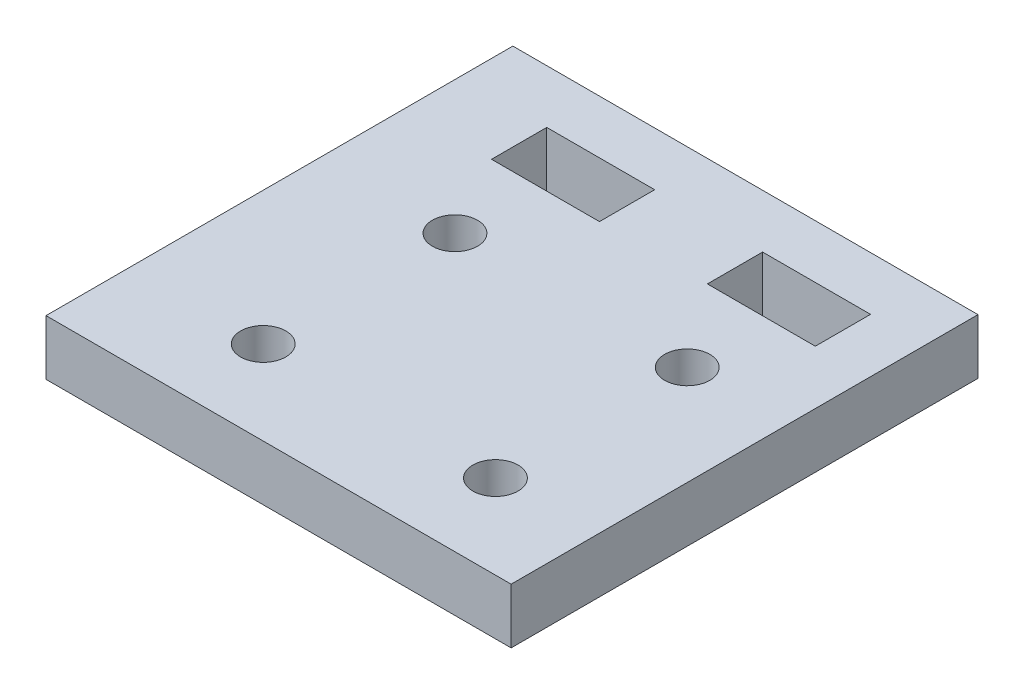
ISO-10303-21;
HEADER;
FILE_DESCRIPTION(('STEP AP214'),'2;1');
FILE_NAME('part.step','',(''),(''),'','','');
FILE_SCHEMA(('AUTOMOTIVE_DESIGN { 1 0 10303 214 1 1 1 1 }'));
ENDSEC;
DATA;
#1=APPLICATION_CONTEXT('core data for automotive mechanical design processes');
#2=APPLICATION_PROTOCOL_DEFINITION('international standard','automotive_design',2000,#1);
#3=PRODUCT_CONTEXT('',#1,'mechanical');
#4=PRODUCT('Part','Part','',(#3));
#5=PRODUCT_RELATED_PRODUCT_CATEGORY('part','',(#4));
#6=PRODUCT_DEFINITION_FORMATION('','',#4);
#7=PRODUCT_DEFINITION_CONTEXT('part definition',#1,'design');
#8=PRODUCT_DEFINITION('design','',#6,#7);
#9=PRODUCT_DEFINITION_SHAPE('','',#8);
#10=(LENGTH_UNIT() NAMED_UNIT(*) SI_UNIT(.MILLI.,.METRE.));
#11=(NAMED_UNIT(*) PLANE_ANGLE_UNIT() SI_UNIT($,.RADIAN.));
#12=(NAMED_UNIT(*) SI_UNIT($,.STERADIAN.) SOLID_ANGLE_UNIT());
#13=UNCERTAINTY_MEASURE_WITH_UNIT(LENGTH_MEASURE(1.E-05),#10,'distance_accuracy_value','');
#14=(GEOMETRIC_REPRESENTATION_CONTEXT(3) GLOBAL_UNCERTAINTY_ASSIGNED_CONTEXT((#13)) GLOBAL_UNIT_ASSIGNED_CONTEXT((#10,
#11,#12)) REPRESENTATION_CONTEXT('',''));
#15=CARTESIAN_POINT('',(0.,0.,0.));
#16=DIRECTION('',(0.,0.,1.));
#17=DIRECTION('',(1.,0.,0.));
#18=AXIS2_PLACEMENT_3D('',#15,#16,#17);
#19=CARTESIAN_POINT('',(0.,5.5,0.));
#20=DIRECTION('',(0.,-1.,0.));
#21=DIRECTION('',(0.,0.,-1.));
#22=AXIS2_PLACEMENT_3D('',#19,#20,#21);
#23=PLANE('',#22);
#24=DIRECTION('',(0.,0.,-1.));
#25=VECTOR('',#24,1.);
#26=CARTESIAN_POINT('',(-26.875,5.5,-48.5));
#27=LINE('',#26,#25);
#28=CARTESIAN_POINT('',(-26.875,5.5,-43.));
#29=VERTEX_POINT('',#28);
#30=CARTESIAN_POINT('',(-26.875,5.5,-48.5));
#31=VERTEX_POINT('',#30);
#32=EDGE_CURVE('E165',#29,#31,#27,.T.);
#33=ORIENTED_EDGE('',*,*,#32,.F.);
#34=DIRECTION('',(1.,0.,0.));
#35=VECTOR('',#34,1.);
#36=CARTESIAN_POINT('',(-26.875,5.5,-43.));
#37=LINE('',#36,#35);
#38=CARTESIAN_POINT('',(-37.625,5.5,-43.));
#39=VERTEX_POINT('',#38);
#40=EDGE_CURVE('E173',#39,#29,#37,.T.);
#41=ORIENTED_EDGE('',*,*,#40,.F.);
#42=DIRECTION('',(0.,0.,1.));
#43=VECTOR('',#42,1.);
#44=CARTESIAN_POINT('',(-37.625,5.5,-43.));
#45=LINE('',#44,#43);
#46=CARTESIAN_POINT('',(-37.625,5.5,-48.5));
#47=VERTEX_POINT('',#46);
#48=EDGE_CURVE('E170',#47,#39,#45,.T.);
#49=ORIENTED_EDGE('',*,*,#48,.F.);
#50=DIRECTION('',(-1.,0.,0.));
#51=VECTOR('',#50,1.);
#52=CARTESIAN_POINT('',(-37.625,5.5,-48.5));
#53=LINE('',#52,#51);
#54=EDGE_CURVE('E167',#31,#47,#53,.T.);
#55=ORIENTED_EDGE('',*,*,#54,.F.);
#56=EDGE_LOOP('',(#33,#41,#49,#55));
#57=FACE_BOUND('',#56,.T.);
#58=DIRECTION('',(0.,0.,-1.));
#59=VECTOR('',#58,1.);
#60=CARTESIAN_POINT('',(0.,5.5,-53.8278175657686));
#61=LINE('',#60,#59);
#62=CARTESIAN_POINT('',(0.,5.5,-7.32781756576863));
#63=VERTEX_POINT('',#62);
#64=CARTESIAN_POINT('',(0.,5.5,-53.8278175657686));
#65=VERTEX_POINT('',#64);
#66=EDGE_CURVE('E196',#63,#65,#61,.T.);
#67=ORIENTED_EDGE('',*,*,#66,.T.);
#68=DIRECTION('',(-1.,0.,0.));
#69=VECTOR('',#68,1.);
#70=CARTESIAN_POINT('',(-46.3278175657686,5.5,-53.8278175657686));
#71=LINE('',#70,#69);
#72=CARTESIAN_POINT('',(-46.3278175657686,5.5,-53.8278175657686));
#73=VERTEX_POINT('',#72);
#74=EDGE_CURVE('E199',#65,#73,#71,.T.);
#75=ORIENTED_EDGE('',*,*,#74,.T.);
#76=DIRECTION('',(0.,0.,1.));
#77=VECTOR('',#76,1.);
#78=CARTESIAN_POINT('',(-46.3278175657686,5.5,-7.32781756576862));
#79=LINE('',#78,#77);
#80=CARTESIAN_POINT('',(-46.3278175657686,5.5,-7.32781756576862));
#81=VERTEX_POINT('',#80);
#82=EDGE_CURVE('E202',#73,#81,#79,.T.);
#83=ORIENTED_EDGE('',*,*,#82,.T.);
#84=DIRECTION('',(1.,0.,0.));
#85=VECTOR('',#84,1.);
#86=CARTESIAN_POINT('',(0.,5.5,-7.32781756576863));
#87=LINE('',#86,#85);
#88=EDGE_CURVE('E204',#81,#63,#87,.T.);
#89=ORIENTED_EDGE('',*,*,#88,.T.);
#90=EDGE_LOOP('',(#67,#75,#83,#89));
#91=FACE_BOUND('',#90,.T.);
#92=DIRECTION('',(1.,0.,0.));
#93=VECTOR('',#92,1.);
#94=CARTESIAN_POINT('',(-5.375,5.5,-43.));
#95=LINE('',#94,#93);
#96=CARTESIAN_POINT('',(-16.125,5.5,-43.));
#97=VERTEX_POINT('',#96);
#98=CARTESIAN_POINT('',(-5.375,5.5,-43.));
#99=VERTEX_POINT('',#98);
#100=EDGE_CURVE('E126',#97,#99,#95,.T.);
#101=ORIENTED_EDGE('',*,*,#100,.F.);
#102=DIRECTION('',(0.,0.,1.));
#103=VECTOR('',#102,1.);
#104=CARTESIAN_POINT('',(-16.125,5.5,-43.));
#105=LINE('',#104,#103);
#106=CARTESIAN_POINT('',(-16.125,5.5,-48.5));
#107=VERTEX_POINT('',#106);
#108=EDGE_CURVE('E149',#107,#97,#105,.T.);
#109=ORIENTED_EDGE('',*,*,#108,.F.);
#110=DIRECTION('',(-1.,0.,0.));
#111=VECTOR('',#110,1.);
#112=CARTESIAN_POINT('',(-16.125,5.5,-48.5));
#113=LINE('',#112,#111);
#114=CARTESIAN_POINT('',(-5.375,5.5,-48.5));
#115=VERTEX_POINT('',#114);
#116=EDGE_CURVE('E147',#115,#107,#113,.T.);
#117=ORIENTED_EDGE('',*,*,#116,.F.);
#118=DIRECTION('',(0.,0.,-1.));
#119=VECTOR('',#118,1.);
#120=CARTESIAN_POINT('',(-5.375,5.5,-48.5));
#121=LINE('',#120,#119);
#122=EDGE_CURVE('E134',#99,#115,#121,.T.);
#123=ORIENTED_EDGE('',*,*,#122,.F.);
#124=EDGE_LOOP('',(#101,#109,#117,#123));
#125=FACE_BOUND('',#124,.T.);
#126=CARTESIAN_POINT('',(-33.067297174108,5.5,-34.7997453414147));
#127=DIRECTION('',(0.,1.,0.));
#128=DIRECTION('',(0.,0.,1.));
#129=AXIS2_PLACEMENT_3D('',#126,#127,#128);
#130=CIRCLE('',#129,2.25);
#131=CARTESIAN_POINT('',(-33.067297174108,5.5,-32.5497453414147));
#132=VERTEX_POINT('',#131);
#133=EDGE_CURVE('E155',#132,#132,#130,.T.);
#134=ORIENTED_EDGE('',*,*,#133,.F.);
#135=EDGE_LOOP('',(#134));
#136=FACE_BOUND('',#135,.T.);
#137=CARTESIAN_POINT('',(-9.93270282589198,5.5,-34.7997453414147));
#138=DIRECTION('',(0.,1.,0.));
#139=DIRECTION('',(0.,0.,1.));
#140=AXIS2_PLACEMENT_3D('',#137,#138,#139);
#141=CIRCLE('',#140,2.25);
#142=CARTESIAN_POINT('',(-9.93270282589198,5.5,-32.5497453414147));
#143=VERTEX_POINT('',#142);
#144=EDGE_CURVE('E335',#143,#143,#141,.T.);
#145=ORIENTED_EDGE('',*,*,#144,.F.);
#146=EDGE_LOOP('',(#145));
#147=FACE_BOUND('',#146,.T.);
#148=CARTESIAN_POINT('',(-9.93270282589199,5.5,-15.7002546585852));
#149=DIRECTION('',(0.,1.,0.));
#150=DIRECTION('',(0.,0.,1.));
#151=AXIS2_PLACEMENT_3D('',#148,#149,#150);
#152=CIRCLE('',#151,2.25);
#153=CARTESIAN_POINT('',(-9.93270282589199,5.5,-13.4502546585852));
#154=VERTEX_POINT('',#153);
#155=EDGE_CURVE('E329',#154,#154,#152,.T.);
#156=ORIENTED_EDGE('',*,*,#155,.F.);
#157=EDGE_LOOP('',(#156));
#158=FACE_BOUND('',#157,.T.);
#159=CARTESIAN_POINT('',(-33.067297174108,5.5,-15.7002546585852));
#160=DIRECTION('',(0.,1.,0.));
#161=DIRECTION('',(0.,0.,1.));
#162=AXIS2_PLACEMENT_3D('',#159,#160,#161);
#163=CIRCLE('',#162,2.25);
#164=CARTESIAN_POINT('',(-33.067297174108,5.5,-13.4502546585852));
#165=VERTEX_POINT('',#164);
#166=EDGE_CURVE('E320',#165,#165,#163,.T.);
#167=ORIENTED_EDGE('',*,*,#166,.F.);
#168=EDGE_LOOP('',(#167));
#169=FACE_BOUND('',#168,.T.);
#170=ADVANCED_FACE('F37',(#57,#91,#125,#136,#147,#158,#169),#23,.F.);
#171=CARTESIAN_POINT('',(0.,0.,0.));
#172=DIRECTION('',(0.,-1.,0.));
#173=DIRECTION('',(0.,0.,-1.));
#174=AXIS2_PLACEMENT_3D('',#171,#172,#173);
#175=PLANE('',#174);
#176=CARTESIAN_POINT('',(-9.93270282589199,0.,-15.7002546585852));
#177=DIRECTION('',(0.,1.,0.));
#178=DIRECTION('',(0.,0.,1.));
#179=AXIS2_PLACEMENT_3D('',#176,#177,#178);
#180=CIRCLE('',#179,2.25);
#181=CARTESIAN_POINT('',(-9.93270282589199,0.,-13.4502546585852));
#182=VERTEX_POINT('',#181);
#183=EDGE_CURVE('E326',#182,#182,#180,.T.);
#184=ORIENTED_EDGE('',*,*,#183,.T.);
#185=EDGE_LOOP('',(#184));
#186=FACE_BOUND('',#185,.T.);
#187=CARTESIAN_POINT('',(-33.067297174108,0.,-34.7997453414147));
#188=DIRECTION('',(0.,1.,0.));
#189=DIRECTION('',(0.,0.,1.));
#190=AXIS2_PLACEMENT_3D('',#187,#188,#189);
#191=CIRCLE('',#190,2.25);
#192=CARTESIAN_POINT('',(-33.067297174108,0.,-32.5497453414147));
#193=VERTEX_POINT('',#192);
#194=EDGE_CURVE('E338',#193,#193,#191,.T.);
#195=ORIENTED_EDGE('',*,*,#194,.T.);
#196=EDGE_LOOP('',(#195));
#197=FACE_BOUND('',#196,.T.);
#198=DIRECTION('',(0.,0.,-1.));
#199=VECTOR('',#198,1.);
#200=CARTESIAN_POINT('',(0.,0.,-53.8278175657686));
#201=LINE('',#200,#199);
#202=CARTESIAN_POINT('',(0.,0.,-7.32781756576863));
#203=VERTEX_POINT('',#202);
#204=CARTESIAN_POINT('',(0.,0.,-53.8278175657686));
#205=VERTEX_POINT('',#204);
#206=EDGE_CURVE('E195',#203,#205,#201,.T.);
#207=ORIENTED_EDGE('',*,*,#206,.F.);
#208=DIRECTION('',(1.,0.,0.));
#209=VECTOR('',#208,1.);
#210=CARTESIAN_POINT('',(0.,0.,-7.32781756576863));
#211=LINE('',#210,#209);
#212=CARTESIAN_POINT('',(-46.3278175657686,0.,-7.32781756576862));
#213=VERTEX_POINT('',#212);
#214=EDGE_CURVE('E200',#213,#203,#211,.T.);
#215=ORIENTED_EDGE('',*,*,#214,.F.);
#216=DIRECTION('',(0.,0.,1.));
#217=VECTOR('',#216,1.);
#218=CARTESIAN_POINT('',(-46.3278175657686,0.,-7.32781756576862));
#219=LINE('',#218,#217);
#220=CARTESIAN_POINT('',(-46.3278175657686,0.,-53.8278175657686));
#221=VERTEX_POINT('',#220);
#222=EDGE_CURVE('E211',#221,#213,#219,.T.);
#223=ORIENTED_EDGE('',*,*,#222,.F.);
#224=DIRECTION('',(-1.,0.,0.));
#225=VECTOR('',#224,1.);
#226=CARTESIAN_POINT('',(-46.3278175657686,0.,-53.8278175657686));
#227=LINE('',#226,#225);
#228=EDGE_CURVE('E209',#205,#221,#227,.T.);
#229=ORIENTED_EDGE('',*,*,#228,.F.);
#230=EDGE_LOOP('',(#207,#215,#223,#229));
#231=FACE_BOUND('',#230,.T.);
#232=DIRECTION('',(1.,0.,0.));
#233=VECTOR('',#232,1.);
#234=CARTESIAN_POINT('',(-26.875,0.,-43.));
#235=LINE('',#234,#233);
#236=CARTESIAN_POINT('',(-37.625,0.,-43.));
#237=VERTEX_POINT('',#236);
#238=CARTESIAN_POINT('',(-26.875,0.,-43.));
#239=VERTEX_POINT('',#238);
#240=EDGE_CURVE('E168',#237,#239,#235,.T.);
#241=ORIENTED_EDGE('',*,*,#240,.T.);
#242=DIRECTION('',(0.,0.,-1.));
#243=VECTOR('',#242,1.);
#244=CARTESIAN_POINT('',(-26.875,0.,-48.5));
#245=LINE('',#244,#243);
#246=CARTESIAN_POINT('',(-26.875,0.,-48.5));
#247=VERTEX_POINT('',#246);
#248=EDGE_CURVE('E142',#239,#247,#245,.T.);
#249=ORIENTED_EDGE('',*,*,#248,.T.);
#250=DIRECTION('',(-1.,0.,0.));
#251=VECTOR('',#250,1.);
#252=CARTESIAN_POINT('',(-37.625,0.,-48.5));
#253=LINE('',#252,#251);
#254=CARTESIAN_POINT('',(-37.625,0.,-48.5));
#255=VERTEX_POINT('',#254);
#256=EDGE_CURVE('E178',#247,#255,#253,.T.);
#257=ORIENTED_EDGE('',*,*,#256,.T.);
#258=DIRECTION('',(0.,0.,1.));
#259=VECTOR('',#258,1.);
#260=CARTESIAN_POINT('',(-37.625,0.,-43.));
#261=LINE('',#260,#259);
#262=EDGE_CURVE('E181',#255,#237,#261,.T.);
#263=ORIENTED_EDGE('',*,*,#262,.T.);
#264=EDGE_LOOP('',(#241,#249,#257,#263));
#265=FACE_BOUND('',#264,.T.);
#266=DIRECTION('',(0.,0.,1.));
#267=VECTOR('',#266,1.);
#268=CARTESIAN_POINT('',(-16.125,0.,-43.));
#269=LINE('',#268,#267);
#270=CARTESIAN_POINT('',(-16.125,0.,-48.5));
#271=VERTEX_POINT('',#270);
#272=CARTESIAN_POINT('',(-16.125,0.,-43.));
#273=VERTEX_POINT('',#272);
#274=EDGE_CURVE('E135',#271,#273,#269,.T.);
#275=ORIENTED_EDGE('',*,*,#274,.T.);
#276=DIRECTION('',(1.,0.,0.));
#277=VECTOR('',#276,1.);
#278=CARTESIAN_POINT('',(-5.375,0.,-43.));
#279=LINE('',#278,#277);
#280=CARTESIAN_POINT('',(-5.375,0.,-43.));
#281=VERTEX_POINT('',#280);
#282=EDGE_CURVE('E60',#273,#281,#279,.T.);
#283=ORIENTED_EDGE('',*,*,#282,.T.);
#284=DIRECTION('',(0.,0.,-1.));
#285=VECTOR('',#284,1.);
#286=CARTESIAN_POINT('',(-5.375,0.,-48.5));
#287=LINE('',#286,#285);
#288=CARTESIAN_POINT('',(-5.375,0.,-48.5));
#289=VERTEX_POINT('',#288);
#290=EDGE_CURVE('E141',#281,#289,#287,.T.);
#291=ORIENTED_EDGE('',*,*,#290,.T.);
#292=DIRECTION('',(-1.,0.,0.));
#293=VECTOR('',#292,1.);
#294=CARTESIAN_POINT('',(-16.125,0.,-48.5));
#295=LINE('',#294,#293);
#296=EDGE_CURVE('E157',#289,#271,#295,.T.);
#297=ORIENTED_EDGE('',*,*,#296,.T.);
#298=EDGE_LOOP('',(#275,#283,#291,#297));
#299=FACE_BOUND('',#298,.T.);
#300=CARTESIAN_POINT('',(-9.93270282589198,0.,-34.7997453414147));
#301=DIRECTION('',(0.,1.,0.));
#302=DIRECTION('',(0.,0.,1.));
#303=AXIS2_PLACEMENT_3D('',#300,#301,#302);
#304=CIRCLE('',#303,2.25);
#305=CARTESIAN_POINT('',(-9.93270282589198,0.,-32.5497453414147));
#306=VERTEX_POINT('',#305);
#307=EDGE_CURVE('E332',#306,#306,#304,.T.);
#308=ORIENTED_EDGE('',*,*,#307,.T.);
#309=EDGE_LOOP('',(#308));
#310=FACE_BOUND('',#309,.T.);
#311=CARTESIAN_POINT('',(-33.067297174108,0.,-15.7002546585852));
#312=DIRECTION('',(0.,1.,0.));
#313=DIRECTION('',(0.,0.,1.));
#314=AXIS2_PLACEMENT_3D('',#311,#312,#313);
#315=CIRCLE('',#314,2.25);
#316=CARTESIAN_POINT('',(-33.067297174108,0.,-13.4502546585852));
#317=VERTEX_POINT('',#316);
#318=EDGE_CURVE('E323',#317,#317,#315,.T.);
#319=ORIENTED_EDGE('',*,*,#318,.T.);
#320=EDGE_LOOP('',(#319));
#321=FACE_BOUND('',#320,.T.);
#322=ADVANCED_FACE('F229',(#186,#197,#231,#265,#299,#310,#321),#175,.T.);
#323=CARTESIAN_POINT('',(0.,5.5,-53.8278175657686));
#324=DIRECTION('',(-1.,0.,0.));
#325=DIRECTION('',(0.,0.,1.));
#326=AXIS2_PLACEMENT_3D('',#323,#324,#325);
#327=PLANE('',#326);
#328=ORIENTED_EDGE('',*,*,#206,.T.);
#329=DIRECTION('',(0.,-1.,0.));
#330=VECTOR('',#329,1.);
#331=CARTESIAN_POINT('',(0.,5.5,-53.8278175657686));
#332=LINE('',#331,#330);
#333=EDGE_CURVE('E11',#65,#205,#332,.T.);
#334=ORIENTED_EDGE('',*,*,#333,.F.);
#335=ORIENTED_EDGE('',*,*,#66,.F.);
#336=DIRECTION('',(0.,-1.,0.));
#337=VECTOR('',#336,1.);
#338=CARTESIAN_POINT('',(0.,5.5,-7.32781756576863));
#339=LINE('',#338,#337);
#340=EDGE_CURVE('E206',#63,#203,#339,.T.);
#341=ORIENTED_EDGE('',*,*,#340,.T.);
#342=EDGE_LOOP('',(#328,#334,#335,#341));
#343=FACE_BOUND('',#342,.T.);
#344=ADVANCED_FACE('F39',(#343),#327,.F.);
#345=CARTESIAN_POINT('',(-46.3278175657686,5.5,-53.8278175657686));
#346=DIRECTION('',(0.,0.,1.));
#347=DIRECTION('',(1.,0.,0.));
#348=AXIS2_PLACEMENT_3D('',#345,#346,#347);
#349=PLANE('',#348);
#350=ORIENTED_EDGE('',*,*,#228,.T.);
#351=DIRECTION('',(0.,-1.,0.));
#352=VECTOR('',#351,1.);
#353=CARTESIAN_POINT('',(-46.3278175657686,5.5,-53.8278175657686));
#354=LINE('',#353,#352);
#355=EDGE_CURVE('E45',#73,#221,#354,.T.);
#356=ORIENTED_EDGE('',*,*,#355,.F.);
#357=ORIENTED_EDGE('',*,*,#74,.F.);
#358=ORIENTED_EDGE('',*,*,#333,.T.);
#359=EDGE_LOOP('',(#350,#356,#357,#358));
#360=FACE_BOUND('',#359,.T.);
#361=ADVANCED_FACE('F239',(#360),#349,.F.);
#362=CARTESIAN_POINT('',(-46.3278175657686,5.5,-7.32781756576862));
#363=DIRECTION('',(1.,0.,0.));
#364=DIRECTION('',(0.,0.,-1.));
#365=AXIS2_PLACEMENT_3D('',#362,#363,#364);
#366=PLANE('',#365);
#367=ORIENTED_EDGE('',*,*,#222,.T.);
#368=DIRECTION('',(0.,-1.,0.));
#369=VECTOR('',#368,1.);
#370=CARTESIAN_POINT('',(-46.3278175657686,5.5,-7.32781756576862));
#371=LINE('',#370,#369);
#372=EDGE_CURVE('E216',#81,#213,#371,.T.);
#373=ORIENTED_EDGE('',*,*,#372,.F.);
#374=ORIENTED_EDGE('',*,*,#82,.F.);
#375=ORIENTED_EDGE('',*,*,#355,.T.);
#376=EDGE_LOOP('',(#367,#373,#374,#375));
#377=FACE_BOUND('',#376,.T.);
#378=ADVANCED_FACE('F223',(#377),#366,.F.);
#379=CARTESIAN_POINT('',(0.,5.5,-7.32781756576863));
#380=DIRECTION('',(0.,0.,-1.));
#381=DIRECTION('',(-1.,0.,0.));
#382=AXIS2_PLACEMENT_3D('',#379,#380,#381);
#383=PLANE('',#382);
#384=ORIENTED_EDGE('',*,*,#214,.T.);
#385=ORIENTED_EDGE('',*,*,#340,.F.);
#386=ORIENTED_EDGE('',*,*,#88,.F.);
#387=ORIENTED_EDGE('',*,*,#372,.T.);
#388=EDGE_LOOP('',(#384,#385,#386,#387));
#389=FACE_BOUND('',#388,.T.);
#390=ADVANCED_FACE('F233',(#389),#383,.F.);
#391=CARTESIAN_POINT('',(-26.875,5.5,-48.5));
#392=DIRECTION('',(-1.,0.,0.));
#393=DIRECTION('',(0.,0.,1.));
#394=AXIS2_PLACEMENT_3D('',#391,#392,#393);
#395=PLANE('',#394);
#396=ORIENTED_EDGE('',*,*,#248,.F.);
#397=DIRECTION('',(0.,-1.,0.));
#398=VECTOR('',#397,1.);
#399=CARTESIAN_POINT('',(-26.875,5.5,-43.));
#400=LINE('',#399,#398);
#401=EDGE_CURVE('E175',#29,#239,#400,.T.);
#402=ORIENTED_EDGE('',*,*,#401,.F.);
#403=ORIENTED_EDGE('',*,*,#32,.T.);
#404=DIRECTION('',(0.,-1.,0.));
#405=VECTOR('',#404,1.);
#406=CARTESIAN_POINT('',(-26.875,5.5,-48.5));
#407=LINE('',#406,#405);
#408=EDGE_CURVE('E192',#31,#247,#407,.T.);
#409=ORIENTED_EDGE('',*,*,#408,.T.);
#410=EDGE_LOOP('',(#396,#402,#403,#409));
#411=FACE_BOUND('',#410,.T.);
#412=ADVANCED_FACE('F256',(#411),#395,.T.);
#413=CARTESIAN_POINT('',(-37.625,5.5,-48.5));
#414=DIRECTION('',(0.,0.,1.));
#415=DIRECTION('',(1.,0.,0.));
#416=AXIS2_PLACEMENT_3D('',#413,#414,#415);
#417=PLANE('',#416);
#418=ORIENTED_EDGE('',*,*,#256,.F.);
#419=ORIENTED_EDGE('',*,*,#408,.F.);
#420=ORIENTED_EDGE('',*,*,#54,.T.);
#421=DIRECTION('',(0.,-1.,0.));
#422=VECTOR('',#421,1.);
#423=CARTESIAN_POINT('',(-37.625,5.5,-48.5));
#424=LINE('',#423,#422);
#425=EDGE_CURVE('E190',#47,#255,#424,.T.);
#426=ORIENTED_EDGE('',*,*,#425,.T.);
#427=EDGE_LOOP('',(#418,#419,#420,#426));
#428=FACE_BOUND('',#427,.T.);
#429=ADVANCED_FACE('F263',(#428),#417,.T.);
#430=CARTESIAN_POINT('',(-37.625,5.5,-43.));
#431=DIRECTION('',(1.,0.,0.));
#432=DIRECTION('',(0.,0.,-1.));
#433=AXIS2_PLACEMENT_3D('',#430,#431,#432);
#434=PLANE('',#433);
#435=ORIENTED_EDGE('',*,*,#262,.F.);
#436=ORIENTED_EDGE('',*,*,#425,.F.);
#437=ORIENTED_EDGE('',*,*,#48,.T.);
#438=DIRECTION('',(0.,-1.,0.));
#439=VECTOR('',#438,1.);
#440=CARTESIAN_POINT('',(-37.625,5.5,-43.));
#441=LINE('',#440,#439);
#442=EDGE_CURVE('E188',#39,#237,#441,.T.);
#443=ORIENTED_EDGE('',*,*,#442,.T.);
#444=EDGE_LOOP('',(#435,#436,#437,#443));
#445=FACE_BOUND('',#444,.T.);
#446=ADVANCED_FACE('F268',(#445),#434,.T.);
#447=CARTESIAN_POINT('',(-26.875,5.5,-43.));
#448=DIRECTION('',(0.,0.,-1.));
#449=DIRECTION('',(-1.,0.,0.));
#450=AXIS2_PLACEMENT_3D('',#447,#448,#449);
#451=PLANE('',#450);
#452=ORIENTED_EDGE('',*,*,#240,.F.);
#453=ORIENTED_EDGE('',*,*,#442,.F.);
#454=ORIENTED_EDGE('',*,*,#40,.T.);
#455=ORIENTED_EDGE('',*,*,#401,.T.);
#456=EDGE_LOOP('',(#452,#453,#454,#455));
#457=FACE_BOUND('',#456,.T.);
#458=ADVANCED_FACE('F274',(#457),#451,.T.);
#459=CARTESIAN_POINT('',(-5.375,5.5,-43.));
#460=DIRECTION('',(0.,0.,-1.));
#461=DIRECTION('',(-1.,0.,0.));
#462=AXIS2_PLACEMENT_3D('',#459,#460,#461);
#463=PLANE('',#462);
#464=ORIENTED_EDGE('',*,*,#282,.F.);
#465=DIRECTION('',(0.,-1.,0.));
#466=VECTOR('',#465,1.);
#467=CARTESIAN_POINT('',(-16.125,5.5,-43.));
#468=LINE('',#467,#466);
#469=EDGE_CURVE('E130',#97,#273,#468,.T.);
#470=ORIENTED_EDGE('',*,*,#469,.F.);
#471=ORIENTED_EDGE('',*,*,#100,.T.);
#472=DIRECTION('',(0.,-1.,0.));
#473=VECTOR('',#472,1.);
#474=CARTESIAN_POINT('',(-5.375,5.5,-43.));
#475=LINE('',#474,#473);
#476=EDGE_CURVE('E129',#99,#281,#475,.T.);
#477=ORIENTED_EDGE('',*,*,#476,.T.);
#478=EDGE_LOOP('',(#464,#470,#471,#477));
#479=FACE_BOUND('',#478,.T.);
#480=ADVANCED_FACE('F128',(#479),#463,.T.);
#481=CARTESIAN_POINT('',(-5.375,5.5,-48.5));
#482=DIRECTION('',(-1.,0.,0.));
#483=DIRECTION('',(0.,0.,1.));
#484=AXIS2_PLACEMENT_3D('',#481,#482,#483);
#485=PLANE('',#484);
#486=ORIENTED_EDGE('',*,*,#290,.F.);
#487=ORIENTED_EDGE('',*,*,#476,.F.);
#488=ORIENTED_EDGE('',*,*,#122,.T.);
#489=DIRECTION('',(0.,-1.,0.));
#490=VECTOR('',#489,1.);
#491=CARTESIAN_POINT('',(-5.375,5.5,-48.5));
#492=LINE('',#491,#490);
#493=EDGE_CURVE('E143',#115,#289,#492,.T.);
#494=ORIENTED_EDGE('',*,*,#493,.T.);
#495=EDGE_LOOP('',(#486,#487,#488,#494));
#496=FACE_BOUND('',#495,.T.);
#497=ADVANCED_FACE('F138',(#496),#485,.T.);
#498=CARTESIAN_POINT('',(-16.125,5.5,-48.5));
#499=DIRECTION('',(0.,0.,1.));
#500=DIRECTION('',(1.,0.,0.));
#501=AXIS2_PLACEMENT_3D('',#498,#499,#500);
#502=PLANE('',#501);
#503=ORIENTED_EDGE('',*,*,#296,.F.);
#504=ORIENTED_EDGE('',*,*,#493,.F.);
#505=ORIENTED_EDGE('',*,*,#116,.T.);
#506=DIRECTION('',(0.,-1.,0.));
#507=VECTOR('',#506,1.);
#508=CARTESIAN_POINT('',(-16.125,5.5,-48.5));
#509=LINE('',#508,#507);
#510=EDGE_CURVE('E52',#107,#271,#509,.T.);
#511=ORIENTED_EDGE('',*,*,#510,.T.);
#512=EDGE_LOOP('',(#503,#504,#505,#511));
#513=FACE_BOUND('',#512,.T.);
#514=ADVANCED_FACE('F293',(#513),#502,.T.);
#515=CARTESIAN_POINT('',(-16.125,5.5,-43.));
#516=DIRECTION('',(1.,0.,0.));
#517=DIRECTION('',(0.,0.,-1.));
#518=AXIS2_PLACEMENT_3D('',#515,#516,#517);
#519=PLANE('',#518);
#520=ORIENTED_EDGE('',*,*,#274,.F.);
#521=ORIENTED_EDGE('',*,*,#510,.F.);
#522=ORIENTED_EDGE('',*,*,#108,.T.);
#523=ORIENTED_EDGE('',*,*,#469,.T.);
#524=EDGE_LOOP('',(#520,#521,#522,#523));
#525=FACE_BOUND('',#524,.T.);
#526=ADVANCED_FACE('F296',(#525),#519,.T.);
#527=CARTESIAN_POINT('',(-33.067297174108,5.5,-34.7997453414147));
#528=DIRECTION('',(0.,-1.,0.));
#529=DIRECTION('',(0.,0.,-1.));
#530=AXIS2_PLACEMENT_3D('',#527,#528,#529);
#531=CYLINDRICAL_SURFACE('',#530,2.25);
#532=ORIENTED_EDGE('',*,*,#133,.T.);
#533=EDGE_LOOP('',(#532));
#534=FACE_BOUND('',#533,.T.);
#535=ORIENTED_EDGE('',*,*,#194,.F.);
#536=EDGE_LOOP('',(#535));
#537=FACE_BOUND('',#536,.T.);
#538=ADVANCED_FACE('F300',(#534,#537),#531,.F.);
#539=CARTESIAN_POINT('',(-9.93270282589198,5.5,-34.7997453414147));
#540=DIRECTION('',(0.,-1.,0.));
#541=DIRECTION('',(0.,0.,-1.));
#542=AXIS2_PLACEMENT_3D('',#539,#540,#541);
#543=CYLINDRICAL_SURFACE('',#542,2.25);
#544=ORIENTED_EDGE('',*,*,#144,.T.);
#545=EDGE_LOOP('',(#544));
#546=FACE_BOUND('',#545,.T.);
#547=ORIENTED_EDGE('',*,*,#307,.F.);
#548=EDGE_LOOP('',(#547));
#549=FACE_BOUND('',#548,.T.);
#550=ADVANCED_FACE('F303',(#546,#549),#543,.F.);
#551=CARTESIAN_POINT('',(-9.93270282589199,5.5,-15.7002546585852));
#552=DIRECTION('',(0.,-1.,0.));
#553=DIRECTION('',(0.,0.,-1.));
#554=AXIS2_PLACEMENT_3D('',#551,#552,#553);
#555=CYLINDRICAL_SURFACE('',#554,2.25);
#556=ORIENTED_EDGE('',*,*,#155,.T.);
#557=EDGE_LOOP('',(#556));
#558=FACE_BOUND('',#557,.T.);
#559=ORIENTED_EDGE('',*,*,#183,.F.);
#560=EDGE_LOOP('',(#559));
#561=FACE_BOUND('',#560,.T.);
#562=ADVANCED_FACE('F307',(#558,#561),#555,.F.);
#563=CARTESIAN_POINT('',(-33.067297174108,5.5,-15.7002546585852));
#564=DIRECTION('',(0.,-1.,0.));
#565=DIRECTION('',(0.,0.,-1.));
#566=AXIS2_PLACEMENT_3D('',#563,#564,#565);
#567=CYLINDRICAL_SURFACE('',#566,2.25);
#568=ORIENTED_EDGE('',*,*,#166,.T.);
#569=EDGE_LOOP('',(#568));
#570=FACE_BOUND('',#569,.T.);
#571=ORIENTED_EDGE('',*,*,#318,.F.);
#572=EDGE_LOOP('',(#571));
#573=FACE_BOUND('',#572,.T.);
#574=ADVANCED_FACE('F311',(#570,#573),#567,.F.);
#575=CLOSED_SHELL('',(#170,#322,#344,#361,#378,#390,#412,#429,#446,#458,#480,#497,#514,#526,
#538,#550,#562,#574));
#576=MANIFOLD_SOLID_BREP('B2',#575);
#577=ADVANCED_BREP_SHAPE_REPRESENTATION('',(#18,#576),#14);
#578=SHAPE_DEFINITION_REPRESENTATION(#9,#577);
ENDSEC;
END-ISO-10303-21;
